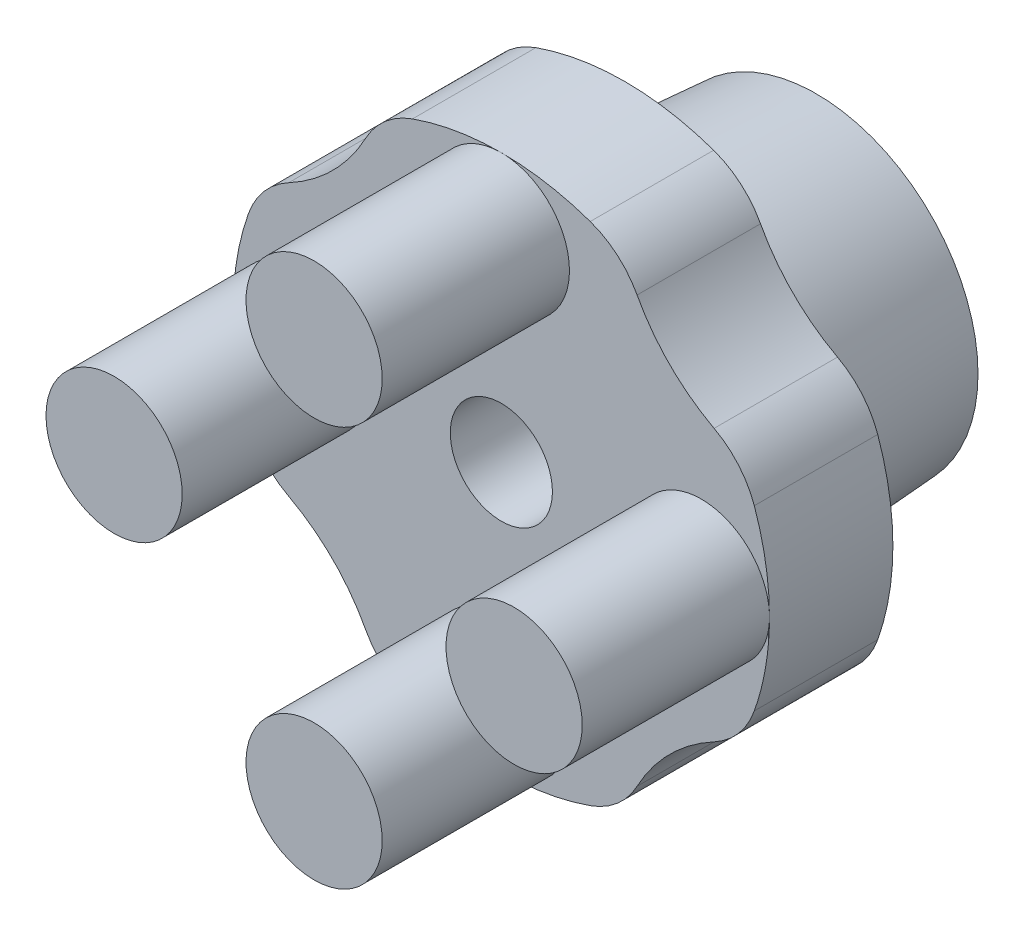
ISO-10303-21;
HEADER;
FILE_DESCRIPTION(('STEP AP214'),'2;1');
FILE_NAME('part.step','',(''),(''),'','','');
FILE_SCHEMA(('AUTOMOTIVE_DESIGN { 1 0 10303 214 1 1 1 1 }'));
ENDSEC;
DATA;
#1=APPLICATION_CONTEXT('core data for automotive mechanical design processes');
#2=APPLICATION_PROTOCOL_DEFINITION('international standard','automotive_design',2000,#1);
#3=PRODUCT_CONTEXT('',#1,'mechanical');
#4=PRODUCT('Part','Part','',(#3));
#5=PRODUCT_RELATED_PRODUCT_CATEGORY('part','',(#4));
#6=PRODUCT_DEFINITION_FORMATION('','',#4);
#7=PRODUCT_DEFINITION_CONTEXT('part definition',#1,'design');
#8=PRODUCT_DEFINITION('design','',#6,#7);
#9=PRODUCT_DEFINITION_SHAPE('','',#8);
#10=(LENGTH_UNIT() NAMED_UNIT(*) SI_UNIT(.MILLI.,.METRE.));
#11=(NAMED_UNIT(*) PLANE_ANGLE_UNIT() SI_UNIT($,.RADIAN.));
#12=(NAMED_UNIT(*) SI_UNIT($,.STERADIAN.) SOLID_ANGLE_UNIT());
#13=UNCERTAINTY_MEASURE_WITH_UNIT(LENGTH_MEASURE(1.E-05),#10,'distance_accuracy_value','');
#14=(GEOMETRIC_REPRESENTATION_CONTEXT(3) GLOBAL_UNCERTAINTY_ASSIGNED_CONTEXT((#13)) GLOBAL_UNIT_ASSIGNED_CONTEXT((#10,
#11,#12)) REPRESENTATION_CONTEXT('',''));
#15=CARTESIAN_POINT('',(0.,0.,0.));
#16=DIRECTION('',(0.,0.,1.));
#17=DIRECTION('',(1.,0.,0.));
#18=AXIS2_PLACEMENT_3D('',#15,#16,#17);
#19=CARTESIAN_POINT('',(0.,0.,90.));
#20=DIRECTION('',(0.,0.,1.));
#21=DIRECTION('',(1.,0.,0.));
#22=AXIS2_PLACEMENT_3D('',#19,#20,#21);
#23=CYLINDRICAL_SURFACE('',#22,31.5);
#24=CARTESIAN_POINT('',(0.,0.,22.5));
#25=DIRECTION('',(0.,0.,1.));
#26=DIRECTION('',(1.,0.,0.));
#27=AXIS2_PLACEMENT_3D('',#24,#25,#26);
#28=CIRCLE('',#27,31.5);
#29=CARTESIAN_POINT('',(-29.7192701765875,10.44102390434,22.5));
#30=VERTEX_POINT('',#29);
#31=CARTESIAN_POINT('',(-29.7192701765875,-10.44102390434,22.5));
#32=VERTEX_POINT('',#31);
#33=EDGE_CURVE('E171',#30,#32,#28,.T.);
#34=ORIENTED_EDGE('',*,*,#33,.T.);
#35=DIRECTION('',(0.,0.,1.));
#36=VECTOR('',#35,1.);
#37=CARTESIAN_POINT('',(-29.7192701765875,-10.44102390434,90.));
#38=LINE('',#37,#36);
#39=CARTESIAN_POINT('',(-29.7192701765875,-10.44102390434,37.));
#40=VERTEX_POINT('',#39);
#41=EDGE_CURVE('E225',#32,#40,#38,.T.);
#42=ORIENTED_EDGE('',*,*,#41,.T.);
#43=CARTESIAN_POINT('',(0.,0.,37.));
#44=DIRECTION('',(0.,0.,1.));
#45=DIRECTION('',(1.,0.,0.));
#46=AXIS2_PLACEMENT_3D('',#43,#44,#45);
#47=CIRCLE('',#46,31.5);
#48=CARTESIAN_POINT('',(-31.5,0.,37.));
#49=VERTEX_POINT('',#48);
#50=EDGE_CURVE('E161',#49,#40,#47,.T.);
#51=ORIENTED_EDGE('',*,*,#50,.F.);
#52=CARTESIAN_POINT('',(-29.7192701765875,10.44102390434,37.));
#53=VERTEX_POINT('',#52);
#54=EDGE_CURVE('E157',#53,#49,#47,.T.);
#55=ORIENTED_EDGE('',*,*,#54,.F.);
#56=DIRECTION('',(0.,0.,1.));
#57=VECTOR('',#56,1.);
#58=CARTESIAN_POINT('',(-29.7192701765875,10.44102390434,90.));
#59=LINE('',#58,#57);
#60=EDGE_CURVE('E223',#53,#30,#59,.F.);
#61=ORIENTED_EDGE('',*,*,#60,.T.);
#62=EDGE_LOOP('',(#34,#42,#51,#55,#61));
#63=FACE_BOUND('',#62,.T.);
#64=ADVANCED_FACE('F14',(#63),#23,.T.);
#65=CARTESIAN_POINT('',(-31.5,0.,37.));
#66=DIRECTION('',(0.,0.,-1.));
#67=DIRECTION('',(-1.,0.,0.));
#68=AXIS2_PLACEMENT_3D('',#65,#66,#67);
#69=PLANE('',#68);
#70=CARTESIAN_POINT('',(0.,0.,37.));
#71=DIRECTION('',(0.,0.,1.));
#72=DIRECTION('',(1.,0.,0.));
#73=AXIS2_PLACEMENT_3D('',#70,#71,#72);
#74=CIRCLE('',#73,6.);
#75=CARTESIAN_POINT('',(6.,0.,37.));
#76=VERTEX_POINT('',#75);
#77=EDGE_CURVE('E319',#76,#76,#74,.T.);
#78=ORIENTED_EDGE('',*,*,#77,.F.);
#79=EDGE_LOOP('',(#78));
#80=FACE_BOUND('',#79,.T.);
#81=CARTESIAN_POINT('',(0.,-31.5,37.));
#82=VERTEX_POINT('',#81);
#83=CARTESIAN_POINT('',(10.44102390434,-29.7192701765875,37.));
#84=VERTEX_POINT('',#83);
#85=EDGE_CURVE('E147',#82,#84,#47,.T.);
#86=ORIENTED_EDGE('',*,*,#85,.T.);
#87=CARTESIAN_POINT('',(7.12641314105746,-20.2845812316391,37.));
#88=DIRECTION('',(0.,0.,-1.));
#89=DIRECTION('',(-1.,0.,0.));
#90=AXIS2_PLACEMENT_3D('',#87,#88,#89);
#91=CIRCLE('',#90,10.);
#92=CARTESIAN_POINT('',(15.9479524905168,-24.9941930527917,37.));
#93=VERTEX_POINT('',#92);
#94=EDGE_CURVE('E246',#84,#93,#91,.F.);
#95=ORIENTED_EDGE('',*,*,#94,.T.);
#96=CARTESIAN_POINT('',(35.3553390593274,-35.3553390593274,37.));
#97=DIRECTION('',(0.,0.,1.));
#98=DIRECTION('',(1.,0.,0.));
#99=AXIS2_PLACEMENT_3D('',#96,#97,#98);
#100=CIRCLE('',#99,22.);
#101=CARTESIAN_POINT('',(24.9941930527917,-15.9479524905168,37.));
#102=VERTEX_POINT('',#101);
#103=EDGE_CURVE('E285',#102,#93,#100,.T.);
#104=ORIENTED_EDGE('',*,*,#103,.F.);
#105=CARTESIAN_POINT('',(20.2845812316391,-7.12641314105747,37.));
#106=DIRECTION('',(0.,0.,-1.));
#107=DIRECTION('',(-1.,0.,0.));
#108=AXIS2_PLACEMENT_3D('',#105,#106,#107);
#109=CIRCLE('',#108,10.);
#110=CARTESIAN_POINT('',(29.7192701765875,-10.44102390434,37.));
#111=VERTEX_POINT('',#110);
#112=EDGE_CURVE('E146',#102,#111,#109,.F.);
#113=ORIENTED_EDGE('',*,*,#112,.T.);
#114=CARTESIAN_POINT('',(31.5,0.,37.));
#115=VERTEX_POINT('',#114);
#116=EDGE_CURVE('E139',#111,#115,#47,.T.);
#117=ORIENTED_EDGE('',*,*,#116,.T.);
#118=CARTESIAN_POINT('',(23.5,0.,37.));
#119=DIRECTION('',(0.,0.,1.));
#120=DIRECTION('',(1.,0.,0.));
#121=AXIS2_PLACEMENT_3D('',#118,#119,#120);
#122=CIRCLE('',#121,8.);
#123=EDGE_CURVE('E144',#115,#115,#122,.T.);
#124=ORIENTED_EDGE('',*,*,#123,.F.);
#125=CARTESIAN_POINT('',(29.7192701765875,10.44102390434,37.));
#126=VERTEX_POINT('',#125);
#127=EDGE_CURVE('E148',#115,#126,#47,.T.);
#128=ORIENTED_EDGE('',*,*,#127,.T.);
#129=CARTESIAN_POINT('',(20.2845812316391,7.12641314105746,37.));
#130=DIRECTION('',(0.,0.,-1.));
#131=DIRECTION('',(-1.,0.,0.));
#132=AXIS2_PLACEMENT_3D('',#129,#130,#131);
#133=CIRCLE('',#132,10.);
#134=CARTESIAN_POINT('',(24.9941930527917,15.9479524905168,37.));
#135=VERTEX_POINT('',#134);
#136=EDGE_CURVE('E207',#126,#135,#133,.F.);
#137=ORIENTED_EDGE('',*,*,#136,.T.);
#138=CARTESIAN_POINT('',(35.3553390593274,35.3553390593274,37.));
#139=DIRECTION('',(0.,0.,-1.));
#140=DIRECTION('',(-1.,0.,0.));
#141=AXIS2_PLACEMENT_3D('',#138,#139,#140);
#142=CIRCLE('',#141,22.);
#143=CARTESIAN_POINT('',(15.9479524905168,24.9941930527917,37.));
#144=VERTEX_POINT('',#143);
#145=EDGE_CURVE('E290',#135,#144,#142,.T.);
#146=ORIENTED_EDGE('',*,*,#145,.T.);
#147=CARTESIAN_POINT('',(7.12641314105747,20.2845812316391,37.));
#148=DIRECTION('',(0.,0.,-1.));
#149=DIRECTION('',(-1.,0.,0.));
#150=AXIS2_PLACEMENT_3D('',#147,#148,#149);
#151=CIRCLE('',#150,10.);
#152=CARTESIAN_POINT('',(10.44102390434,29.7192701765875,37.));
#153=VERTEX_POINT('',#152);
#154=EDGE_CURVE('E203',#144,#153,#151,.F.);
#155=ORIENTED_EDGE('',*,*,#154,.T.);
#156=CARTESIAN_POINT('',(0.,31.5,37.));
#157=VERTEX_POINT('',#156);
#158=EDGE_CURVE('E155',#153,#157,#47,.T.);
#159=ORIENTED_EDGE('',*,*,#158,.T.);
#160=CARTESIAN_POINT('',(0.,23.5,37.));
#161=DIRECTION('',(0.,0.,1.));
#162=DIRECTION('',(1.,0.,0.));
#163=AXIS2_PLACEMENT_3D('',#160,#161,#162);
#164=CIRCLE('',#163,8.);
#165=EDGE_CURVE('E277',#157,#157,#164,.T.);
#166=ORIENTED_EDGE('',*,*,#165,.F.);
#167=CARTESIAN_POINT('',(-10.44102390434,29.7192701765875,37.));
#168=VERTEX_POINT('',#167);
#169=EDGE_CURVE('E156',#157,#168,#47,.T.);
#170=ORIENTED_EDGE('',*,*,#169,.T.);
#171=CARTESIAN_POINT('',(-7.12641314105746,20.2845812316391,37.));
#172=DIRECTION('',(0.,0.,-1.));
#173=DIRECTION('',(-1.,0.,0.));
#174=AXIS2_PLACEMENT_3D('',#171,#172,#173);
#175=CIRCLE('',#174,10.);
#176=CARTESIAN_POINT('',(-15.9479524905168,24.9941930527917,37.));
#177=VERTEX_POINT('',#176);
#178=EDGE_CURVE('E202',#168,#177,#175,.F.);
#179=ORIENTED_EDGE('',*,*,#178,.T.);
#180=CARTESIAN_POINT('',(-35.3553390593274,35.3553390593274,37.));
#181=DIRECTION('',(0.,0.,1.));
#182=DIRECTION('',(1.,0.,0.));
#183=AXIS2_PLACEMENT_3D('',#180,#181,#182);
#184=CIRCLE('',#183,22.);
#185=CARTESIAN_POINT('',(-24.9941930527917,15.9479524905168,37.));
#186=VERTEX_POINT('',#185);
#187=EDGE_CURVE('E302',#186,#177,#184,.T.);
#188=ORIENTED_EDGE('',*,*,#187,.F.);
#189=CARTESIAN_POINT('',(-20.2845812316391,7.12641314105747,37.));
#190=DIRECTION('',(0.,0.,-1.));
#191=DIRECTION('',(-1.,0.,0.));
#192=AXIS2_PLACEMENT_3D('',#189,#190,#191);
#193=CIRCLE('',#192,10.);
#194=EDGE_CURVE('E309',#186,#53,#193,.F.);
#195=ORIENTED_EDGE('',*,*,#194,.T.);
#196=ORIENTED_EDGE('',*,*,#54,.T.);
#197=CARTESIAN_POINT('',(-23.5,0.,37.));
#198=DIRECTION('',(0.,0.,1.));
#199=DIRECTION('',(1.,0.,0.));
#200=AXIS2_PLACEMENT_3D('',#197,#198,#199);
#201=CIRCLE('',#200,8.);
#202=EDGE_CURVE('E269',#49,#49,#201,.T.);
#203=ORIENTED_EDGE('',*,*,#202,.F.);
#204=ORIENTED_EDGE('',*,*,#50,.T.);
#205=CARTESIAN_POINT('',(-20.2845812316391,-7.12641314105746,37.));
#206=DIRECTION('',(0.,0.,-1.));
#207=DIRECTION('',(-1.,0.,0.));
#208=AXIS2_PLACEMENT_3D('',#205,#206,#207);
#209=CIRCLE('',#208,10.);
#210=CARTESIAN_POINT('',(-24.9941930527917,-15.9479524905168,37.));
#211=VERTEX_POINT('',#210);
#212=EDGE_CURVE('E230',#40,#211,#209,.F.);
#213=ORIENTED_EDGE('',*,*,#212,.T.);
#214=CARTESIAN_POINT('',(-35.3553390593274,-35.3553390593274,37.));
#215=DIRECTION('',(0.,0.,-1.));
#216=DIRECTION('',(-1.,0.,0.));
#217=AXIS2_PLACEMENT_3D('',#214,#215,#216);
#218=CIRCLE('',#217,22.);
#219=CARTESIAN_POINT('',(-15.9479524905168,-24.9941930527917,37.));
#220=VERTEX_POINT('',#219);
#221=EDGE_CURVE('E296',#211,#220,#218,.T.);
#222=ORIENTED_EDGE('',*,*,#221,.T.);
#223=CARTESIAN_POINT('',(-7.12641314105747,-20.2845812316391,37.));
#224=DIRECTION('',(0.,0.,-1.));
#225=DIRECTION('',(-1.,0.,0.));
#226=AXIS2_PLACEMENT_3D('',#223,#224,#225);
#227=CIRCLE('',#226,10.);
#228=CARTESIAN_POINT('',(-10.44102390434,-29.7192701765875,37.));
#229=VERTEX_POINT('',#228);
#230=EDGE_CURVE('E228',#220,#229,#227,.F.);
#231=ORIENTED_EDGE('',*,*,#230,.T.);
#232=EDGE_CURVE('E150',#229,#82,#47,.T.);
#233=ORIENTED_EDGE('',*,*,#232,.T.);
#234=CARTESIAN_POINT('',(0.,-23.5,37.));
#235=DIRECTION('',(0.,0.,1.));
#236=DIRECTION('',(1.,0.,0.));
#237=AXIS2_PLACEMENT_3D('',#234,#235,#236);
#238=CIRCLE('',#237,8.);
#239=EDGE_CURVE('E263',#82,#82,#238,.T.);
#240=ORIENTED_EDGE('',*,*,#239,.F.);
#241=EDGE_LOOP('',(#86,#95,#104,#113,#117,#124,#128,#137,#146,#155,#159,#166,#170,#179,#188,
#195,#196,#203,#204,#213,#222,#231,#233,#240));
#242=FACE_BOUND('',#241,.T.);
#243=ADVANCED_FACE('F16',(#80,#242),#69,.F.);
#244=CARTESIAN_POINT('',(-20.5,0.,22.5));
#245=DIRECTION('',(0.,0.,1.));
#246=DIRECTION('',(1.,0.,0.));
#247=AXIS2_PLACEMENT_3D('',#244,#245,#246);
#248=PLANE('',#247);
#249=CARTESIAN_POINT('',(0.,0.,22.5));
#250=DIRECTION('',(0.,0.,1.));
#251=DIRECTION('',(1.,0.,0.));
#252=AXIS2_PLACEMENT_3D('',#249,#250,#251);
#253=CIRCLE('',#252,20.5);
#254=CARTESIAN_POINT('',(20.5,0.,22.5));
#255=VERTEX_POINT('',#254);
#256=EDGE_CURVE('E180',#255,#255,#253,.T.);
#257=ORIENTED_EDGE('',*,*,#256,.T.);
#258=EDGE_LOOP('',(#257));
#259=FACE_BOUND('',#258,.T.);
#260=CARTESIAN_POINT('',(35.3553390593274,-35.3553390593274,22.5));
#261=DIRECTION('',(0.,0.,1.));
#262=DIRECTION('',(1.,0.,0.));
#263=AXIS2_PLACEMENT_3D('',#260,#261,#262);
#264=CIRCLE('',#263,22.);
#265=CARTESIAN_POINT('',(24.9941930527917,-15.9479524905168,22.5));
#266=VERTEX_POINT('',#265);
#267=CARTESIAN_POINT('',(15.9479524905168,-24.9941930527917,22.5));
#268=VERTEX_POINT('',#267);
#269=EDGE_CURVE('E256',#266,#268,#264,.T.);
#270=ORIENTED_EDGE('',*,*,#269,.T.);
#271=CARTESIAN_POINT('',(7.12641314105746,-20.2845812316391,22.5));
#272=DIRECTION('',(0.,0.,1.));
#273=DIRECTION('',(1.,0.,0.));
#274=AXIS2_PLACEMENT_3D('',#271,#272,#273);
#275=CIRCLE('',#274,10.);
#276=CARTESIAN_POINT('',(10.44102390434,-29.7192701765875,22.5));
#277=VERTEX_POINT('',#276);
#278=EDGE_CURVE('E22',#268,#277,#275,.F.);
#279=ORIENTED_EDGE('',*,*,#278,.T.);
#280=CARTESIAN_POINT('',(-10.44102390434,-29.7192701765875,22.5));
#281=VERTEX_POINT('',#280);
#282=EDGE_CURVE('E167',#281,#277,#28,.T.);
#283=ORIENTED_EDGE('',*,*,#282,.F.);
#284=CARTESIAN_POINT('',(-7.12641314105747,-20.2845812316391,22.5));
#285=DIRECTION('',(0.,0.,1.));
#286=DIRECTION('',(1.,0.,0.));
#287=AXIS2_PLACEMENT_3D('',#284,#285,#286);
#288=CIRCLE('',#287,10.);
#289=CARTESIAN_POINT('',(-15.9479524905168,-24.9941930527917,22.5));
#290=VERTEX_POINT('',#289);
#291=EDGE_CURVE('E237',#281,#290,#288,.F.);
#292=ORIENTED_EDGE('',*,*,#291,.T.);
#293=CARTESIAN_POINT('',(-35.3553390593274,-35.3553390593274,22.5));
#294=DIRECTION('',(0.,0.,1.));
#295=DIRECTION('',(1.,0.,0.));
#296=AXIS2_PLACEMENT_3D('',#293,#294,#295);
#297=CIRCLE('',#296,22.);
#298=CARTESIAN_POINT('',(-24.9941930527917,-15.9479524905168,22.5));
#299=VERTEX_POINT('',#298);
#300=EDGE_CURVE('E293',#299,#290,#297,.F.);
#301=ORIENTED_EDGE('',*,*,#300,.F.);
#302=CARTESIAN_POINT('',(-20.2845812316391,-7.12641314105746,22.5));
#303=DIRECTION('',(0.,0.,1.));
#304=DIRECTION('',(1.,0.,0.));
#305=AXIS2_PLACEMENT_3D('',#302,#303,#304);
#306=CIRCLE('',#305,10.);
#307=EDGE_CURVE('E239',#299,#32,#306,.F.);
#308=ORIENTED_EDGE('',*,*,#307,.T.);
#309=ORIENTED_EDGE('',*,*,#33,.F.);
#310=CARTESIAN_POINT('',(-20.2845812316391,7.12641314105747,22.5));
#311=DIRECTION('',(0.,0.,1.));
#312=DIRECTION('',(1.,0.,0.));
#313=AXIS2_PLACEMENT_3D('',#310,#311,#312);
#314=CIRCLE('',#313,10.);
#315=CARTESIAN_POINT('',(-24.9941930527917,15.9479524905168,22.5));
#316=VERTEX_POINT('',#315);
#317=EDGE_CURVE('E205',#30,#316,#314,.F.);
#318=ORIENTED_EDGE('',*,*,#317,.T.);
#319=CARTESIAN_POINT('',(-35.3553390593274,35.3553390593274,22.5));
#320=DIRECTION('',(0.,0.,1.));
#321=DIRECTION('',(1.,0.,0.));
#322=AXIS2_PLACEMENT_3D('',#319,#320,#321);
#323=CIRCLE('',#322,22.);
#324=CARTESIAN_POINT('',(-15.9479524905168,24.9941930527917,22.5));
#325=VERTEX_POINT('',#324);
#326=EDGE_CURVE('E299',#316,#325,#323,.T.);
#327=ORIENTED_EDGE('',*,*,#326,.T.);
#328=CARTESIAN_POINT('',(-7.12641314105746,20.2845812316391,22.5));
#329=DIRECTION('',(0.,0.,1.));
#330=DIRECTION('',(1.,0.,0.));
#331=AXIS2_PLACEMENT_3D('',#328,#329,#330);
#332=CIRCLE('',#331,10.);
#333=CARTESIAN_POINT('',(-10.44102390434,29.7192701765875,22.5));
#334=VERTEX_POINT('',#333);
#335=EDGE_CURVE('E201',#325,#334,#332,.F.);
#336=ORIENTED_EDGE('',*,*,#335,.T.);
#337=CARTESIAN_POINT('',(10.44102390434,29.7192701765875,22.5));
#338=VERTEX_POINT('',#337);
#339=EDGE_CURVE('E178',#338,#334,#28,.T.);
#340=ORIENTED_EDGE('',*,*,#339,.F.);
#341=CARTESIAN_POINT('',(7.12641314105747,20.2845812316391,22.5));
#342=DIRECTION('',(0.,0.,1.));
#343=DIRECTION('',(1.,0.,0.));
#344=AXIS2_PLACEMENT_3D('',#341,#342,#343);
#345=CIRCLE('',#344,10.);
#346=CARTESIAN_POINT('',(15.9479524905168,24.9941930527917,22.5));
#347=VERTEX_POINT('',#346);
#348=EDGE_CURVE('E215',#338,#347,#345,.F.);
#349=ORIENTED_EDGE('',*,*,#348,.T.);
#350=CARTESIAN_POINT('',(35.3553390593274,35.3553390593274,22.5));
#351=DIRECTION('',(0.,0.,1.));
#352=DIRECTION('',(1.,0.,0.));
#353=AXIS2_PLACEMENT_3D('',#350,#351,#352);
#354=CIRCLE('',#353,22.);
#355=CARTESIAN_POINT('',(24.9941930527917,15.9479524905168,22.5));
#356=VERTEX_POINT('',#355);
#357=EDGE_CURVE('E287',#356,#347,#354,.F.);
#358=ORIENTED_EDGE('',*,*,#357,.F.);
#359=CARTESIAN_POINT('',(20.2845812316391,7.12641314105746,22.5));
#360=DIRECTION('',(0.,0.,1.));
#361=DIRECTION('',(1.,0.,0.));
#362=AXIS2_PLACEMENT_3D('',#359,#360,#361);
#363=CIRCLE('',#362,10.);
#364=CARTESIAN_POINT('',(29.7192701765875,10.44102390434,22.5));
#365=VERTEX_POINT('',#364);
#366=EDGE_CURVE('E213',#356,#365,#363,.F.);
#367=ORIENTED_EDGE('',*,*,#366,.T.);
#368=CARTESIAN_POINT('',(29.7192701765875,-10.44102390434,22.5));
#369=VERTEX_POINT('',#368);
#370=EDGE_CURVE('E172',#369,#365,#28,.T.);
#371=ORIENTED_EDGE('',*,*,#370,.F.);
#372=CARTESIAN_POINT('',(20.2845812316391,-7.12641314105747,22.5));
#373=DIRECTION('',(0.,0.,1.));
#374=DIRECTION('',(1.,0.,0.));
#375=AXIS2_PLACEMENT_3D('',#372,#373,#374);
#376=CIRCLE('',#375,10.);
#377=EDGE_CURVE('E252',#369,#266,#376,.F.);
#378=ORIENTED_EDGE('',*,*,#377,.T.);
#379=EDGE_LOOP('',(#270,#279,#283,#292,#301,#308,#309,#318,#327,#336,#340,#349,#358,#367,#371,#378));
#380=FACE_BOUND('',#379,.T.);
#381=ADVANCED_FACE('F254',(#259,#380),#248,.F.);
#382=ORIENTED_EDGE('',*,*,#282,.T.);
#383=DIRECTION('',(0.,0.,1.));
#384=VECTOR('',#383,1.);
#385=CARTESIAN_POINT('',(10.44102390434,-29.7192701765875,90.));
#386=LINE('',#385,#384);
#387=EDGE_CURVE('E243',#277,#84,#386,.T.);
#388=ORIENTED_EDGE('',*,*,#387,.T.);
#389=ORIENTED_EDGE('',*,*,#85,.F.);
#390=ORIENTED_EDGE('',*,*,#232,.F.);
#391=DIRECTION('',(0.,0.,1.));
#392=VECTOR('',#391,1.);
#393=CARTESIAN_POINT('',(-10.44102390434,-29.7192701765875,90.));
#394=LINE('',#393,#392);
#395=EDGE_CURVE('E241',#229,#281,#394,.F.);
#396=ORIENTED_EDGE('',*,*,#395,.T.);
#397=EDGE_LOOP('',(#382,#388,#389,#390,#396));
#398=FACE_BOUND('',#397,.T.);
#399=ADVANCED_FACE('F259',(#398),#23,.T.);
#400=ORIENTED_EDGE('',*,*,#158,.F.);
#401=DIRECTION('',(0.,0.,1.));
#402=VECTOR('',#401,1.);
#403=CARTESIAN_POINT('',(10.44102390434,29.7192701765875,90.));
#404=LINE('',#403,#402);
#405=EDGE_CURVE('E194',#153,#338,#404,.F.);
#406=ORIENTED_EDGE('',*,*,#405,.T.);
#407=ORIENTED_EDGE('',*,*,#339,.T.);
#408=DIRECTION('',(0.,0.,1.));
#409=VECTOR('',#408,1.);
#410=CARTESIAN_POINT('',(-10.44102390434,29.7192701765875,90.));
#411=LINE('',#410,#409);
#412=EDGE_CURVE('E192',#334,#168,#411,.T.);
#413=ORIENTED_EDGE('',*,*,#412,.T.);
#414=ORIENTED_EDGE('',*,*,#169,.F.);
#415=EDGE_LOOP('',(#400,#406,#407,#413,#414));
#416=FACE_BOUND('',#415,.T.);
#417=ADVANCED_FACE('F190',(#416),#23,.T.);
#418=ORIENTED_EDGE('',*,*,#116,.F.);
#419=DIRECTION('',(0.,0.,1.));
#420=VECTOR('',#419,1.);
#421=CARTESIAN_POINT('',(29.7192701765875,-10.44102390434,90.));
#422=LINE('',#421,#420);
#423=EDGE_CURVE('E9',#111,#369,#422,.F.);
#424=ORIENTED_EDGE('',*,*,#423,.T.);
#425=ORIENTED_EDGE('',*,*,#370,.T.);
#426=DIRECTION('',(0.,0.,1.));
#427=VECTOR('',#426,1.);
#428=CARTESIAN_POINT('',(29.7192701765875,10.44102390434,90.));
#429=LINE('',#428,#427);
#430=EDGE_CURVE('E154',#365,#126,#429,.T.);
#431=ORIENTED_EDGE('',*,*,#430,.T.);
#432=ORIENTED_EDGE('',*,*,#127,.F.);
#433=EDGE_LOOP('',(#418,#424,#425,#431,#432));
#434=FACE_BOUND('',#433,.T.);
#435=ADVANCED_FACE('F152',(#434),#23,.T.);
#436=CARTESIAN_POINT('',(0.,0.,90.));
#437=DIRECTION('',(0.,0.,1.));
#438=DIRECTION('',(1.,0.,0.));
#439=AXIS2_PLACEMENT_3D('',#436,#437,#438);
#440=CYLINDRICAL_SURFACE('',#439,6.);
#441=CARTESIAN_POINT('',(0.,0.,0.));
#442=DIRECTION('',(0.,0.,1.));
#443=DIRECTION('',(1.,0.,0.));
#444=AXIS2_PLACEMENT_3D('',#441,#442,#443);
#445=CIRCLE('',#444,6.);
#446=CARTESIAN_POINT('',(6.,0.,0.));
#447=VERTEX_POINT('',#446);
#448=EDGE_CURVE('E322',#447,#447,#445,.T.);
#449=ORIENTED_EDGE('',*,*,#448,.F.);
#450=EDGE_LOOP('',(#449));
#451=FACE_BOUND('',#450,.T.);
#452=ORIENTED_EDGE('',*,*,#77,.T.);
#453=EDGE_LOOP('',(#452));
#454=FACE_BOUND('',#453,.T.);
#455=ADVANCED_FACE('F334',(#451,#454),#440,.F.);
#456=CARTESIAN_POINT('',(-6.,0.,0.));
#457=DIRECTION('',(0.,0.,1.));
#458=DIRECTION('',(1.,0.,0.));
#459=AXIS2_PLACEMENT_3D('',#456,#457,#458);
#460=PLANE('',#459);
#461=CARTESIAN_POINT('',(0.,0.,0.));
#462=DIRECTION('',(0.,0.,1.));
#463=DIRECTION('',(1.,0.,0.));
#464=AXIS2_PLACEMENT_3D('',#461,#462,#463);
#465=CIRCLE('',#464,19.);
#466=CARTESIAN_POINT('',(19.,0.,0.));
#467=VERTEX_POINT('',#466);
#468=EDGE_CURVE('E183',#467,#467,#465,.T.);
#469=ORIENTED_EDGE('',*,*,#468,.F.);
#470=EDGE_LOOP('',(#469));
#471=FACE_BOUND('',#470,.T.);
#472=ORIENTED_EDGE('',*,*,#448,.T.);
#473=EDGE_LOOP('',(#472));
#474=FACE_BOUND('',#473,.T.);
#475=ADVANCED_FACE('F331',(#471,#474),#460,.F.);
#476=CARTESIAN_POINT('',(0.,0.,22.5));
#477=DIRECTION('',(0.,0.,1.));
#478=DIRECTION('',(1.,0.,0.));
#479=AXIS2_PLACEMENT_3D('',#476,#477,#478);
#480=CONICAL_SURFACE('',#479,20.5,0.0665681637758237);
#481=ORIENTED_EDGE('',*,*,#468,.T.);
#482=EDGE_LOOP('',(#481));
#483=FACE_BOUND('',#482,.T.);
#484=ORIENTED_EDGE('',*,*,#256,.F.);
#485=EDGE_LOOP('',(#484));
#486=FACE_BOUND('',#485,.T.);
#487=ADVANCED_FACE('F328',(#483,#486),#480,.T.);
#488=CARTESIAN_POINT('',(0.,-23.5,59.));
#489=DIRECTION('',(0.,0.,-1.));
#490=DIRECTION('',(-1.,0.,0.));
#491=AXIS2_PLACEMENT_3D('',#488,#489,#490);
#492=CYLINDRICAL_SURFACE('',#491,8.);
#493=CARTESIAN_POINT('',(0.,-23.5,59.));
#494=DIRECTION('',(0.,0.,1.));
#495=DIRECTION('',(1.,0.,0.));
#496=AXIS2_PLACEMENT_3D('',#493,#494,#495);
#497=CIRCLE('',#496,8.);
#498=CARTESIAN_POINT('',(8.,-23.5,59.));
#499=VERTEX_POINT('',#498);
#500=EDGE_CURVE('E166',#499,#499,#497,.T.);
#501=ORIENTED_EDGE('',*,*,#500,.F.);
#502=EDGE_LOOP('',(#501));
#503=FACE_BOUND('',#502,.T.);
#504=ORIENTED_EDGE('',*,*,#239,.T.);
#505=EDGE_LOOP('',(#504));
#506=FACE_BOUND('',#505,.T.);
#507=ADVANCED_FACE('F383',(#503,#506),#492,.T.);
#508=CARTESIAN_POINT('',(0.,-23.5,59.));
#509=DIRECTION('',(0.,0.,1.));
#510=DIRECTION('',(1.,0.,0.));
#511=AXIS2_PLACEMENT_3D('',#508,#509,#510);
#512=PLANE('',#511);
#513=ORIENTED_EDGE('',*,*,#500,.T.);
#514=EDGE_LOOP('',(#513));
#515=FACE_BOUND('',#514,.T.);
#516=ADVANCED_FACE('F385',(#515),#512,.T.);
#517=CARTESIAN_POINT('',(-23.5,0.,59.));
#518=DIRECTION('',(0.,0.,-1.));
#519=DIRECTION('',(-1.,0.,0.));
#520=AXIS2_PLACEMENT_3D('',#517,#518,#519);
#521=CYLINDRICAL_SURFACE('',#520,8.);
#522=CARTESIAN_POINT('',(-23.5,0.,59.));
#523=DIRECTION('',(0.,0.,1.));
#524=DIRECTION('',(1.,0.,0.));
#525=AXIS2_PLACEMENT_3D('',#522,#523,#524);
#526=CIRCLE('',#525,8.);
#527=CARTESIAN_POINT('',(-15.5,0.,59.));
#528=VERTEX_POINT('',#527);
#529=EDGE_CURVE('E265',#528,#528,#526,.T.);
#530=ORIENTED_EDGE('',*,*,#529,.F.);
#531=EDGE_LOOP('',(#530));
#532=FACE_BOUND('',#531,.T.);
#533=ORIENTED_EDGE('',*,*,#202,.T.);
#534=EDGE_LOOP('',(#533));
#535=FACE_BOUND('',#534,.T.);
#536=ADVANCED_FACE('F400',(#532,#535),#521,.T.);
#537=CARTESIAN_POINT('',(-23.5,0.,59.));
#538=DIRECTION('',(0.,0.,1.));
#539=DIRECTION('',(1.,0.,0.));
#540=AXIS2_PLACEMENT_3D('',#537,#538,#539);
#541=PLANE('',#540);
#542=ORIENTED_EDGE('',*,*,#529,.T.);
#543=EDGE_LOOP('',(#542));
#544=FACE_BOUND('',#543,.T.);
#545=ADVANCED_FACE('F393',(#544),#541,.T.);
#546=CARTESIAN_POINT('',(0.,23.5,59.));
#547=DIRECTION('',(0.,0.,-1.));
#548=DIRECTION('',(-1.,0.,0.));
#549=AXIS2_PLACEMENT_3D('',#546,#547,#548);
#550=CYLINDRICAL_SURFACE('',#549,8.);
#551=CARTESIAN_POINT('',(0.,23.5,59.));
#552=DIRECTION('',(0.,0.,1.));
#553=DIRECTION('',(1.,0.,0.));
#554=AXIS2_PLACEMENT_3D('',#551,#552,#553);
#555=CIRCLE('',#554,8.);
#556=CARTESIAN_POINT('',(8.,23.5,59.));
#557=VERTEX_POINT('',#556);
#558=EDGE_CURVE('E274',#557,#557,#555,.T.);
#559=ORIENTED_EDGE('',*,*,#558,.F.);
#560=EDGE_LOOP('',(#559));
#561=FACE_BOUND('',#560,.T.);
#562=ORIENTED_EDGE('',*,*,#165,.T.);
#563=EDGE_LOOP('',(#562));
#564=FACE_BOUND('',#563,.T.);
#565=ADVANCED_FACE('F418',(#561,#564),#550,.T.);
#566=CARTESIAN_POINT('',(0.,23.5,59.));
#567=DIRECTION('',(0.,0.,1.));
#568=DIRECTION('',(1.,0.,0.));
#569=AXIS2_PLACEMENT_3D('',#566,#567,#568);
#570=PLANE('',#569);
#571=ORIENTED_EDGE('',*,*,#558,.T.);
#572=EDGE_LOOP('',(#571));
#573=FACE_BOUND('',#572,.T.);
#574=ADVANCED_FACE('F411',(#573),#570,.T.);
#575=CARTESIAN_POINT('',(23.5,0.,59.));
#576=DIRECTION('',(0.,0.,-1.));
#577=DIRECTION('',(-1.,0.,0.));
#578=AXIS2_PLACEMENT_3D('',#575,#576,#577);
#579=CYLINDRICAL_SURFACE('',#578,8.);
#580=CARTESIAN_POINT('',(23.5,0.,59.));
#581=DIRECTION('',(0.,0.,1.));
#582=DIRECTION('',(1.,0.,0.));
#583=AXIS2_PLACEMENT_3D('',#580,#581,#582);
#584=CIRCLE('',#583,8.);
#585=CARTESIAN_POINT('',(31.5,0.,59.));
#586=VERTEX_POINT('',#585);
#587=EDGE_CURVE('E280',#586,#586,#584,.T.);
#588=ORIENTED_EDGE('',*,*,#587,.F.);
#589=EDGE_LOOP('',(#588));
#590=FACE_BOUND('',#589,.T.);
#591=ORIENTED_EDGE('',*,*,#123,.T.);
#592=EDGE_LOOP('',(#591));
#593=FACE_BOUND('',#592,.T.);
#594=ADVANCED_FACE('F436',(#590,#593),#579,.T.);
#595=CARTESIAN_POINT('',(23.5,0.,59.));
#596=DIRECTION('',(0.,0.,1.));
#597=DIRECTION('',(1.,0.,0.));
#598=AXIS2_PLACEMENT_3D('',#595,#596,#597);
#599=PLANE('',#598);
#600=ORIENTED_EDGE('',*,*,#587,.T.);
#601=EDGE_LOOP('',(#600));
#602=FACE_BOUND('',#601,.T.);
#603=ADVANCED_FACE('F429',(#602),#599,.T.);
#604=CARTESIAN_POINT('',(35.3553390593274,-35.3553390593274,0.));
#605=DIRECTION('',(0.,0.,1.));
#606=DIRECTION('',(1.,0.,0.));
#607=AXIS2_PLACEMENT_3D('',#604,#605,#606);
#608=CYLINDRICAL_SURFACE('',#607,22.);
#609=ORIENTED_EDGE('',*,*,#103,.T.);
#610=DIRECTION('',(0.,0.,1.));
#611=VECTOR('',#610,1.);
#612=CARTESIAN_POINT('',(15.9479524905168,-24.9941930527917,0.));
#613=LINE('',#612,#611);
#614=EDGE_CURVE('E35',#93,#268,#613,.F.);
#615=ORIENTED_EDGE('',*,*,#614,.T.);
#616=ORIENTED_EDGE('',*,*,#269,.F.);
#617=DIRECTION('',(0.,0.,1.));
#618=VECTOR('',#617,1.);
#619=CARTESIAN_POINT('',(24.9941930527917,-15.9479524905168,0.));
#620=LINE('',#619,#618);
#621=EDGE_CURVE('E248',#266,#102,#620,.T.);
#622=ORIENTED_EDGE('',*,*,#621,.T.);
#623=EDGE_LOOP('',(#609,#615,#616,#622));
#624=FACE_BOUND('',#623,.T.);
#625=ADVANCED_FACE('F447',(#624),#608,.F.);
#626=CARTESIAN_POINT('',(35.3553390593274,35.3553390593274,0.));
#627=DIRECTION('',(0.,0.,1.));
#628=DIRECTION('',(1.,0.,0.));
#629=AXIS2_PLACEMENT_3D('',#626,#627,#628);
#630=CYLINDRICAL_SURFACE('',#629,22.);
#631=ORIENTED_EDGE('',*,*,#357,.T.);
#632=DIRECTION('',(0.,0.,1.));
#633=VECTOR('',#632,1.);
#634=CARTESIAN_POINT('',(15.9479524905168,24.9941930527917,0.));
#635=LINE('',#634,#633);
#636=EDGE_CURVE('E312',#347,#144,#635,.T.);
#637=ORIENTED_EDGE('',*,*,#636,.T.);
#638=ORIENTED_EDGE('',*,*,#145,.F.);
#639=DIRECTION('',(0.,0.,1.));
#640=VECTOR('',#639,1.);
#641=CARTESIAN_POINT('',(24.9941930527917,15.9479524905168,0.));
#642=LINE('',#641,#640);
#643=EDGE_CURVE('E317',#135,#356,#642,.F.);
#644=ORIENTED_EDGE('',*,*,#643,.T.);
#645=EDGE_LOOP('',(#631,#637,#638,#644));
#646=FACE_BOUND('',#645,.T.);
#647=ADVANCED_FACE('F462',(#646),#630,.F.);
#648=CARTESIAN_POINT('',(-35.3553390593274,-35.3553390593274,0.));
#649=DIRECTION('',(0.,0.,1.));
#650=DIRECTION('',(1.,0.,0.));
#651=AXIS2_PLACEMENT_3D('',#648,#649,#650);
#652=CYLINDRICAL_SURFACE('',#651,22.);
#653=ORIENTED_EDGE('',*,*,#221,.F.);
#654=DIRECTION('',(0.,0.,1.));
#655=VECTOR('',#654,1.);
#656=CARTESIAN_POINT('',(-24.9941930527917,-15.9479524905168,0.));
#657=LINE('',#656,#655);
#658=EDGE_CURVE('E235',#211,#299,#657,.F.);
#659=ORIENTED_EDGE('',*,*,#658,.T.);
#660=ORIENTED_EDGE('',*,*,#300,.T.);
#661=DIRECTION('',(0.,0.,1.));
#662=VECTOR('',#661,1.);
#663=CARTESIAN_POINT('',(-15.9479524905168,-24.9941930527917,0.));
#664=LINE('',#663,#662);
#665=EDGE_CURVE('E232',#290,#220,#664,.T.);
#666=ORIENTED_EDGE('',*,*,#665,.T.);
#667=EDGE_LOOP('',(#653,#659,#660,#666));
#668=FACE_BOUND('',#667,.T.);
#669=ADVANCED_FACE('F470',(#668),#652,.F.);
#670=CARTESIAN_POINT('',(-35.3553390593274,35.3553390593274,0.));
#671=DIRECTION('',(0.,0.,1.));
#672=DIRECTION('',(1.,0.,0.));
#673=AXIS2_PLACEMENT_3D('',#670,#671,#672);
#674=CYLINDRICAL_SURFACE('',#673,22.);
#675=ORIENTED_EDGE('',*,*,#187,.T.);
#676=DIRECTION('',(0.,0.,1.));
#677=VECTOR('',#676,1.);
#678=CARTESIAN_POINT('',(-15.9479524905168,24.9941930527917,0.));
#679=LINE('',#678,#677);
#680=EDGE_CURVE('E221',#177,#325,#679,.F.);
#681=ORIENTED_EDGE('',*,*,#680,.T.);
#682=ORIENTED_EDGE('',*,*,#326,.F.);
#683=DIRECTION('',(0.,0.,1.));
#684=VECTOR('',#683,1.);
#685=CARTESIAN_POINT('',(-24.9941930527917,15.9479524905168,0.));
#686=LINE('',#685,#684);
#687=EDGE_CURVE('E218',#316,#186,#686,.T.);
#688=ORIENTED_EDGE('',*,*,#687,.T.);
#689=EDGE_LOOP('',(#675,#681,#682,#688));
#690=FACE_BOUND('',#689,.T.);
#691=ADVANCED_FACE('F306',(#690),#674,.F.);
#692=CARTESIAN_POINT('',(7.12641314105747,20.2845812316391,90.));
#693=DIRECTION('',(0.,0.,-1.));
#694=DIRECTION('',(-1.,0.,0.));
#695=AXIS2_PLACEMENT_3D('',#692,#693,#694);
#696=CYLINDRICAL_SURFACE('',#695,10.);
#697=ORIENTED_EDGE('',*,*,#348,.F.);
#698=ORIENTED_EDGE('',*,*,#405,.F.);
#699=ORIENTED_EDGE('',*,*,#154,.F.);
#700=ORIENTED_EDGE('',*,*,#636,.F.);
#701=EDGE_LOOP('',(#697,#698,#699,#700));
#702=FACE_BOUND('',#701,.T.);
#703=ADVANCED_FACE('F487',(#702),#696,.T.);
#704=CARTESIAN_POINT('',(20.2845812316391,7.12641314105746,0.));
#705=DIRECTION('',(0.,0.,-1.));
#706=DIRECTION('',(-1.,0.,0.));
#707=AXIS2_PLACEMENT_3D('',#704,#705,#706);
#708=CYLINDRICAL_SURFACE('',#707,10.);
#709=ORIENTED_EDGE('',*,*,#366,.F.);
#710=ORIENTED_EDGE('',*,*,#643,.F.);
#711=ORIENTED_EDGE('',*,*,#136,.F.);
#712=ORIENTED_EDGE('',*,*,#430,.F.);
#713=EDGE_LOOP('',(#709,#710,#711,#712));
#714=FACE_BOUND('',#713,.T.);
#715=ADVANCED_FACE('F495',(#714),#708,.T.);
#716=CARTESIAN_POINT('',(-7.12641314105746,20.2845812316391,0.));
#717=DIRECTION('',(0.,0.,-1.));
#718=DIRECTION('',(-1.,0.,0.));
#719=AXIS2_PLACEMENT_3D('',#716,#717,#718);
#720=CYLINDRICAL_SURFACE('',#719,10.);
#721=ORIENTED_EDGE('',*,*,#335,.F.);
#722=ORIENTED_EDGE('',*,*,#680,.F.);
#723=ORIENTED_EDGE('',*,*,#178,.F.);
#724=ORIENTED_EDGE('',*,*,#412,.F.);
#725=EDGE_LOOP('',(#721,#722,#723,#724));
#726=FACE_BOUND('',#725,.T.);
#727=ADVANCED_FACE('F199',(#726),#720,.T.);
#728=CARTESIAN_POINT('',(-20.2845812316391,7.12641314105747,90.));
#729=DIRECTION('',(0.,0.,-1.));
#730=DIRECTION('',(-1.,0.,0.));
#731=AXIS2_PLACEMENT_3D('',#728,#729,#730);
#732=CYLINDRICAL_SURFACE('',#731,10.);
#733=ORIENTED_EDGE('',*,*,#317,.F.);
#734=ORIENTED_EDGE('',*,*,#60,.F.);
#735=ORIENTED_EDGE('',*,*,#194,.F.);
#736=ORIENTED_EDGE('',*,*,#687,.F.);
#737=EDGE_LOOP('',(#733,#734,#735,#736));
#738=FACE_BOUND('',#737,.T.);
#739=ADVANCED_FACE('F512',(#738),#732,.T.);
#740=CARTESIAN_POINT('',(-20.2845812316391,-7.12641314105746,0.));
#741=DIRECTION('',(0.,0.,-1.));
#742=DIRECTION('',(-1.,0.,0.));
#743=AXIS2_PLACEMENT_3D('',#740,#741,#742);
#744=CYLINDRICAL_SURFACE('',#743,10.);
#745=ORIENTED_EDGE('',*,*,#307,.F.);
#746=ORIENTED_EDGE('',*,*,#658,.F.);
#747=ORIENTED_EDGE('',*,*,#212,.F.);
#748=ORIENTED_EDGE('',*,*,#41,.F.);
#749=EDGE_LOOP('',(#745,#746,#747,#748));
#750=FACE_BOUND('',#749,.T.);
#751=ADVANCED_FACE('F520',(#750),#744,.T.);
#752=CARTESIAN_POINT('',(-7.12641314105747,-20.2845812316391,90.));
#753=DIRECTION('',(0.,0.,-1.));
#754=DIRECTION('',(-1.,0.,0.));
#755=AXIS2_PLACEMENT_3D('',#752,#753,#754);
#756=CYLINDRICAL_SURFACE('',#755,10.);
#757=ORIENTED_EDGE('',*,*,#291,.F.);
#758=ORIENTED_EDGE('',*,*,#395,.F.);
#759=ORIENTED_EDGE('',*,*,#230,.F.);
#760=ORIENTED_EDGE('',*,*,#665,.F.);
#761=EDGE_LOOP('',(#757,#758,#759,#760));
#762=FACE_BOUND('',#761,.T.);
#763=ADVANCED_FACE('F529',(#762),#756,.T.);
#764=CARTESIAN_POINT('',(7.12641314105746,-20.2845812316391,0.));
#765=DIRECTION('',(0.,0.,-1.));
#766=DIRECTION('',(-1.,0.,0.));
#767=AXIS2_PLACEMENT_3D('',#764,#765,#766);
#768=CYLINDRICAL_SURFACE('',#767,10.);
#769=ORIENTED_EDGE('',*,*,#278,.F.);
#770=ORIENTED_EDGE('',*,*,#614,.F.);
#771=ORIENTED_EDGE('',*,*,#94,.F.);
#772=ORIENTED_EDGE('',*,*,#387,.F.);
#773=EDGE_LOOP('',(#769,#770,#771,#772));
#774=FACE_BOUND('',#773,.T.);
#775=ADVANCED_FACE('F258',(#774),#768,.T.);
#776=CARTESIAN_POINT('',(20.2845812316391,-7.12641314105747,90.));
#777=DIRECTION('',(0.,0.,-1.));
#778=DIRECTION('',(-1.,0.,0.));
#779=AXIS2_PLACEMENT_3D('',#776,#777,#778);
#780=CYLINDRICAL_SURFACE('',#779,10.);
#781=ORIENTED_EDGE('',*,*,#377,.F.);
#782=ORIENTED_EDGE('',*,*,#423,.F.);
#783=ORIENTED_EDGE('',*,*,#112,.F.);
#784=ORIENTED_EDGE('',*,*,#621,.F.);
#785=EDGE_LOOP('',(#781,#782,#783,#784));
#786=FACE_BOUND('',#785,.T.);
#787=ADVANCED_FACE('F546',(#786),#780,.T.);
#788=CLOSED_SHELL('',(#64,#243,#381,#399,#417,#435,#455,#475,#487,#507,#516,#536,#545,#565,#574,
#594,#603,#625,#647,#669,#691,#703,#715,#727,#739,#751,#763,#775,#787));
#789=MANIFOLD_SOLID_BREP('B1',#788);
#790=ADVANCED_BREP_SHAPE_REPRESENTATION('',(#18,#789),#14);
#791=SHAPE_DEFINITION_REPRESENTATION(#9,#790);
ENDSEC;
END-ISO-10303-21;
